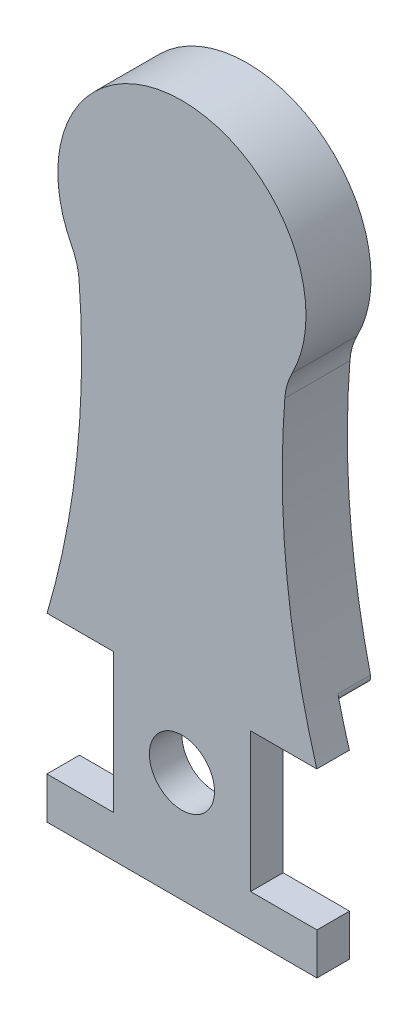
from build123d import *

# Parameters (mm, degrees)
BODY_DEPTH            = 10
SKETCH2_R             = 5
ATTACHMENT_HOLE_DEPTH = 107.750930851
CUT_EXTRUDE28_DEPTH   = 107.750930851
CUT_EXTRUDE30_DEPTH   = 5
FILLET1_R             = 10
FILLET2_R             = 10
FILLET5_R             = 1
FILLET6_R             = 1


with BuildPart() as part:
    # Sketch1 → Body (new body)
    with BuildSketch(Plane.XY):
        with BuildLine():
            ThreePointArc((-57.453333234, -48.209070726), (-24.034507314, 1.033281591), (-16, 60))
            ThreePointArc((-16, 60), (0, 89.414069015), (16, 60))
            ThreePointArc((16, 60), (24.034507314, 1.033281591), (57.453333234, -48.209070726))
            ThreePointArc((57.453333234, -48.209070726), (0, -75), (-57.453333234, -48.209070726))
        make_face()
    extrude(amount=BODY_DEPTH)

    # Sketch2 → Attachment Hole (cut, through all)
    with BuildSketch(Plane.XY.offset(10)):
        Circle(SKETCH2_R)
    extrude(amount=-ATTACHMENT_HOLE_DEPTH, mode=Mode.SUBTRACT)

    # Sketch34 → Cut-Extrude28 (cut, through all)
    with BuildSketch(Plane.XY.offset(10)):
        with BuildLine():
            Line((-20.993197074, 10.845815), (-10.542895, 10.845815))
            Line((-10.542895, 10.845815), (-10.542895, -10.542895))
            Line((-10.542895, -10.542895), (-20.741205, -10.542895))
            Line((-20.741205, -10.542895), (-20.741205, -16.942445))
            Line((-20.741205, -16.942445), (20.741205, -16.942445))
            Line((20.741205, -16.942445), (20.741205, -10.542895))
            Line((20.741205, -10.542895), (10.542895, -10.542895))
            Line((10.542895, -10.542895), (10.542895, 10.845815))
            Line((10.542895, 10.845815), (20.993197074, 10.845815))
            ThreePointArc((20.993197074, 10.845815), (36.689111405, -20.246199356), (57.453333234, -48.209070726))
            ThreePointArc((57.453333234, -48.209070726), (0, -75), (-57.453333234, -48.209070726))
            ThreePointArc((-57.453333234, -48.209070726), (-35.302517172, -21.102274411), (-20.993197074, 10.845815))
        make_face()
    extrude(amount=-CUT_EXTRUDE28_DEPTH, mode=Mode.SUBTRACT)

    # Sketch35 → Cut-Extrude30 (cut)
    with BuildSketch(Plane(origin=(0, 0, 0), x_dir=(-1, 0, 0), z_dir=(0, 0, -1))):
        with BuildLine():
            Line((20.993197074, 10.845815), (10.542895, 10.845815))
            Line((10.542895, 10.845815), (10.542895, -10.542895))
            Line((10.542895, -10.542895), (20.741205, -10.542895))
            Line((20.741205, -10.542895), (20.741205, -16.942445))
            Line((20.741205, -16.942445), (-20.741205, -16.942445))
            Line((-20.741205, -16.942445), (-20.741205, -10.542895))
            Line((-20.741205, -10.542895), (-10.542895, -10.542895))
            Line((-10.542895, -10.542895), (-10.542895, 10.845815))
            Line((-10.542895, 10.845815), (-20.993197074, 10.845815))
            ThreePointArc((-20.993197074, 10.845815), (-20.562072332, 11.857349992), (-20.137728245, 12.871748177))
            ThreePointArc((-20.137728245, 12.871748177), (0, 23.9), (20.137728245, 12.871748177))
            ThreePointArc((20.137728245, 12.871748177), (20.561480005, 11.857099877), (20.993197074, 10.845815))
        make_face()
    extrude(amount=-CUT_EXTRUDE30_DEPTH, mode=Mode.SUBTRACT)

    # Fillet1
    fillet1_edges = [part.edges().sort_by_distance(p)[0] for p in [
        (16, 60, 5),
    ]]
    fillet(fillet1_edges, radius=FILLET1_R)

    # Fillet2
    fillet2_edges = [part.edges().sort_by_distance(p)[0] for p in [
        (-16, 60, 5),
    ]]
    fillet(fillet2_edges, radius=FILLET2_R)

    # Fillet5
    fillet5_edges = [part.edges().sort_by_distance(p)[0] for p in [
        (20.137728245, 12.871748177, 2.5),
    ]]
    fillet(fillet5_edges, radius=FILLET5_R)

    # Fillet6
    fillet6_edges = [part.edges().sort_by_distance(p)[0] for p in [
        (-20.137728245, 12.871748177, 2.5),
    ]]
    fillet(fillet6_edges, radius=FILLET6_R)


solid = part.part
